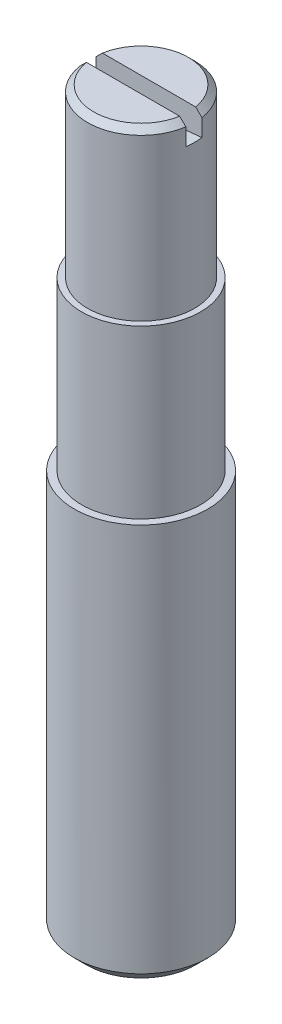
ISO-10303-21;
HEADER;
FILE_DESCRIPTION(('STEP AP214'),'2;1');
FILE_NAME('part.step','',(''),(''),'','','');
FILE_SCHEMA(('AUTOMOTIVE_DESIGN { 1 0 10303 214 1 1 1 1 }'));
ENDSEC;
DATA;
#1=APPLICATION_CONTEXT('core data for automotive mechanical design processes');
#2=APPLICATION_PROTOCOL_DEFINITION('international standard','automotive_design',2000,#1);
#3=PRODUCT_CONTEXT('',#1,'mechanical');
#4=PRODUCT('Part','Part','',(#3));
#5=PRODUCT_RELATED_PRODUCT_CATEGORY('part','',(#4));
#6=PRODUCT_DEFINITION_FORMATION('','',#4);
#7=PRODUCT_DEFINITION_CONTEXT('part definition',#1,'design');
#8=PRODUCT_DEFINITION('design','',#6,#7);
#9=PRODUCT_DEFINITION_SHAPE('','',#8);
#10=(LENGTH_UNIT() NAMED_UNIT(*) SI_UNIT(.MILLI.,.METRE.));
#11=(NAMED_UNIT(*) PLANE_ANGLE_UNIT() SI_UNIT($,.RADIAN.));
#12=(NAMED_UNIT(*) SI_UNIT($,.STERADIAN.) SOLID_ANGLE_UNIT());
#13=UNCERTAINTY_MEASURE_WITH_UNIT(LENGTH_MEASURE(1.E-05),#10,'distance_accuracy_value','');
#14=(GEOMETRIC_REPRESENTATION_CONTEXT(3) GLOBAL_UNCERTAINTY_ASSIGNED_CONTEXT((#13)) GLOBAL_UNIT_ASSIGNED_CONTEXT((#10,
#11,#12)) REPRESENTATION_CONTEXT('',''));
#15=CARTESIAN_POINT('',(0.,0.,0.));
#16=DIRECTION('',(0.,0.,1.));
#17=DIRECTION('',(1.,0.,0.));
#18=AXIS2_PLACEMENT_3D('',#15,#16,#17);
#19=CARTESIAN_POINT('',(0.,50.,0.));
#20=DIRECTION('',(0.,-1.,0.));
#21=DIRECTION('',(0.,0.,-1.));
#22=AXIS2_PLACEMENT_3D('',#19,#20,#21);
#23=PLANE('',#22);
#24=CARTESIAN_POINT('',(0.,50.0000000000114,0.));
#25=DIRECTION('',(0.,-1.,0.));
#26=DIRECTION('',(0.,0.,-1.));
#27=AXIS2_PLACEMENT_3D('',#24,#25,#26);
#28=CIRCLE('',#27,3.53999999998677);
#29=CARTESIAN_POINT('',(-3.48878202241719,50.0000000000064,-0.6));
#30=VERTEX_POINT('',#29);
#31=CARTESIAN_POINT('',(3.48878202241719,50.0000000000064,-0.6));
#32=VERTEX_POINT('',#31);
#33=EDGE_CURVE('E165',#30,#32,#28,.T.);
#34=ORIENTED_EDGE('',*,*,#33,.F.);
#35=DIRECTION('',(1.,0.,0.));
#36=VECTOR('',#35,1.);
#37=CARTESIAN_POINT('',(0.,50.,-0.6));
#38=LINE('',#37,#36);
#39=EDGE_CURVE('E163',#32,#30,#38,.F.);
#40=ORIENTED_EDGE('',*,*,#39,.F.);
#41=EDGE_LOOP('',(#34,#40));
#42=FACE_BOUND('',#41,.T.);
#43=ADVANCED_FACE('F14',(#42),#23,.F.);
#44=CARTESIAN_POINT('',(0.,50.,0.));
#45=DIRECTION('',(0.,-1.,0.));
#46=DIRECTION('',(0.,0.,-1.));
#47=AXIS2_PLACEMENT_3D('',#44,#45,#46);
#48=PLANE('',#47);
#49=DIRECTION('',(1.,0.,0.));
#50=VECTOR('',#49,1.);
#51=CARTESIAN_POINT('',(0.,50.,0.6));
#52=LINE('',#51,#50);
#53=CARTESIAN_POINT('',(-3.48878202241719,50.0000000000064,0.6));
#54=VERTEX_POINT('',#53);
#55=CARTESIAN_POINT('',(3.48878202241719,50.0000000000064,0.6));
#56=VERTEX_POINT('',#55);
#57=EDGE_CURVE('E161',#54,#56,#52,.T.);
#58=ORIENTED_EDGE('',*,*,#57,.F.);
#59=CARTESIAN_POINT('',(0.,50.0000000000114,0.));
#60=DIRECTION('',(0.,-1.,0.));
#61=DIRECTION('',(0.,0.,-1.));
#62=AXIS2_PLACEMENT_3D('',#59,#60,#61);
#63=CIRCLE('',#62,3.53999999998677);
#64=EDGE_CURVE('E159',#56,#54,#63,.T.);
#65=ORIENTED_EDGE('',*,*,#64,.F.);
#66=EDGE_LOOP('',(#58,#65));
#67=FACE_BOUND('',#66,.T.);
#68=ADVANCED_FACE('F121',(#67),#48,.F.);
#69=CARTESIAN_POINT('',(0.,49.5399999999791,0.));
#70=DIRECTION('',(0.,-1.,0.));
#71=DIRECTION('',(0.,0.,-1.));
#72=AXIS2_PLACEMENT_3D('',#69,#70,#71);
#73=CONICAL_SURFACE('',#72,3.99999999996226,0.785398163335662);
#74=CARTESIAN_POINT('',(-3.48878202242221,50.0000000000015,-0.6));
#75=CARTESIAN_POINT('',(-3.56650335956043,49.9233951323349,-0.6));
#76=CARTESIAN_POINT('',(-3.64419419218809,49.8467593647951,-0.6));
#77=CARTESIAN_POINT('',(-3.79951484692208,49.6934260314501,-0.6));
#78=CARTESIAN_POINT('',(-3.87714466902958,49.6167284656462,-0.6));
#79=CARTESIAN_POINT('',(-3.9547439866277,49.5399999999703,-0.6));
#80=B_SPLINE_CURVE_WITH_KNOTS('',3,(#74,#75,#76,#77,#78,#79),.UNSPECIFIED.,.F.,.F.,(4,2,4),(0.,
0.327383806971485,0.654767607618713),.UNSPECIFIED.);
#81=CARTESIAN_POINT('',(-3.95474398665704,49.5399999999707,-0.6));
#82=VERTEX_POINT('',#81);
#83=EDGE_CURVE('E39',#30,#82,#80,.T.);
#84=ORIENTED_EDGE('',*,*,#83,.F.);
#85=ORIENTED_EDGE('',*,*,#33,.T.);
#86=CARTESIAN_POINT('',(3.95474398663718,49.5399999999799,-0.600000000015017));
#87=CARTESIAN_POINT('',(3.87714466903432,49.616728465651,-0.600000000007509));
#88=CARTESIAN_POINT('',(3.79951484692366,49.6934260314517,-0.600000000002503));
#89=CARTESIAN_POINT('',(3.64419419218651,49.8467593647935,-0.599999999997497));
#90=CARTESIAN_POINT('',(3.56650335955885,49.9233951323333,-0.599999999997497));
#91=CARTESIAN_POINT('',(3.48878202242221,50.0000000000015,-0.6));
#92=B_SPLINE_CURVE_WITH_KNOTS('',3,(#86,#87,#88,#89,#90,#91),.UNSPECIFIED.,.F.,.F.,(4,2,4),(0.,
0.327383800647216,0.654767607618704),.UNSPECIFIED.);
#93=CARTESIAN_POINT('',(3.95474398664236,49.5399999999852,-0.6));
#94=VERTEX_POINT('',#93);
#95=EDGE_CURVE('E134',#94,#32,#92,.T.);
#96=ORIENTED_EDGE('',*,*,#95,.F.);
#97=CARTESIAN_POINT('',(0.,49.54,0.));
#98=DIRECTION('',(0.,-1.,0.));
#99=DIRECTION('',(0.,0.,-1.));
#100=AXIS2_PLACEMENT_3D('',#97,#98,#99);
#101=CIRCLE('',#100,4.);
#102=EDGE_CURVE('E175',#82,#94,#101,.T.);
#103=ORIENTED_EDGE('',*,*,#102,.F.);
#104=EDGE_LOOP('',(#84,#85,#96,#103));
#105=FACE_BOUND('',#104,.T.);
#106=ADVANCED_FACE('F116',(#105),#73,.T.);
#107=CARTESIAN_POINT('',(0.,79.5,-0.6));
#108=DIRECTION('',(0.,0.,1.));
#109=DIRECTION('',(1.,0.,0.));
#110=AXIS2_PLACEMENT_3D('',#107,#108,#109);
#111=PLANE('',#110);
#112=ORIENTED_EDGE('',*,*,#39,.T.);
#113=ORIENTED_EDGE('',*,*,#83,.T.);
#114=DIRECTION('',(0.,1.,0.));
#115=VECTOR('',#114,1.);
#116=CARTESIAN_POINT('',(-3.95474398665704,79.5,-0.6));
#117=LINE('',#116,#115);
#118=CARTESIAN_POINT('',(-3.95474398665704,48.2492400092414,-0.6));
#119=VERTEX_POINT('',#118);
#120=EDGE_CURVE('E154',#82,#119,#117,.F.);
#121=ORIENTED_EDGE('',*,*,#120,.T.);
#122=CARTESIAN_POINT('',(0.,79.5,-0.6));
#123=DIRECTION('',(0.,0.,-1.));
#124=DIRECTION('',(-1.,0.,0.));
#125=AXIS2_PLACEMENT_3D('',#122,#123,#124);
#126=CIRCLE('',#125,31.5);
#127=CARTESIAN_POINT('',(3.95474398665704,48.2492400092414,-0.6));
#128=VERTEX_POINT('',#127);
#129=EDGE_CURVE('E89',#119,#128,#126,.F.);
#130=ORIENTED_EDGE('',*,*,#129,.T.);
#131=DIRECTION('',(0.,1.,0.));
#132=VECTOR('',#131,1.);
#133=CARTESIAN_POINT('',(3.95474398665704,79.5,-0.6));
#134=LINE('',#133,#132);
#135=EDGE_CURVE('E140',#128,#94,#134,.T.);
#136=ORIENTED_EDGE('',*,*,#135,.T.);
#137=ORIENTED_EDGE('',*,*,#95,.T.);
#138=EDGE_LOOP('',(#112,#113,#121,#130,#136,#137));
#139=FACE_BOUND('',#138,.T.);
#140=ADVANCED_FACE('F120',(#139),#111,.T.);
#141=CARTESIAN_POINT('',(0.,49.5399999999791,0.));
#142=DIRECTION('',(0.,-1.,0.));
#143=DIRECTION('',(0.,0.,-1.));
#144=AXIS2_PLACEMENT_3D('',#141,#142,#143);
#145=CONICAL_SURFACE('',#144,3.99999999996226,0.785398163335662);
#146=ORIENTED_EDGE('',*,*,#64,.T.);
#147=CARTESIAN_POINT('',(-3.48878202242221,50.0000000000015,0.6));
#148=CARTESIAN_POINT('',(-3.56650335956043,49.9233951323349,0.6));
#149=CARTESIAN_POINT('',(-3.64419419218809,49.8467593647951,0.6));
#150=CARTESIAN_POINT('',(-3.79951484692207,49.6934260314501,0.6));
#151=CARTESIAN_POINT('',(-3.87714466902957,49.6167284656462,0.6));
#152=CARTESIAN_POINT('',(-3.95474398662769,49.5399999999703,0.6));
#153=B_SPLINE_CURVE_WITH_KNOTS('',3,(#147,#148,#149,#150,#151,#152),.UNSPECIFIED.,.F.,.F.,(4,2,
4),(0.,0.327383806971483,0.654767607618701),.UNSPECIFIED.);
#154=CARTESIAN_POINT('',(-3.95474398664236,49.5399999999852,0.6));
#155=VERTEX_POINT('',#154);
#156=EDGE_CURVE('E149',#54,#155,#153,.T.);
#157=ORIENTED_EDGE('',*,*,#156,.T.);
#158=CARTESIAN_POINT('',(0.,49.54,0.));
#159=DIRECTION('',(0.,-1.,0.));
#160=DIRECTION('',(0.,0.,-1.));
#161=AXIS2_PLACEMENT_3D('',#158,#159,#160);
#162=CIRCLE('',#161,4.);
#163=CARTESIAN_POINT('',(3.95474398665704,49.5399999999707,0.6));
#164=VERTEX_POINT('',#163);
#165=EDGE_CURVE('E79',#164,#155,#162,.T.);
#166=ORIENTED_EDGE('',*,*,#165,.F.);
#167=CARTESIAN_POINT('',(3.95474398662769,49.5399999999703,0.6));
#168=CARTESIAN_POINT('',(3.87714466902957,49.6167284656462,0.6));
#169=CARTESIAN_POINT('',(3.79951484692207,49.6934260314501,0.6));
#170=CARTESIAN_POINT('',(3.64419419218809,49.8467593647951,0.6));
#171=CARTESIAN_POINT('',(3.56650335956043,49.9233951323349,0.6));
#172=CARTESIAN_POINT('',(3.48878202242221,50.0000000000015,0.6));
#173=B_SPLINE_CURVE_WITH_KNOTS('',3,(#167,#168,#169,#170,#171,#172),.UNSPECIFIED.,.F.,.F.,(4,2,
4),(0.,0.327383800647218,0.654767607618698),.UNSPECIFIED.);
#174=EDGE_CURVE('E97',#164,#56,#173,.T.);
#175=ORIENTED_EDGE('',*,*,#174,.T.);
#176=EDGE_LOOP('',(#146,#157,#166,#175));
#177=FACE_BOUND('',#176,.T.);
#178=ADVANCED_FACE('F122',(#177),#145,.T.);
#179=CARTESIAN_POINT('',(0.,79.5,0.6));
#180=DIRECTION('',(0.,0.,1.));
#181=DIRECTION('',(1.,0.,0.));
#182=AXIS2_PLACEMENT_3D('',#179,#180,#181);
#183=PLANE('',#182);
#184=ORIENTED_EDGE('',*,*,#57,.T.);
#185=ORIENTED_EDGE('',*,*,#174,.F.);
#186=DIRECTION('',(0.,1.,0.));
#187=VECTOR('',#186,1.);
#188=CARTESIAN_POINT('',(3.95474398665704,79.5,0.6));
#189=LINE('',#188,#187);
#190=CARTESIAN_POINT('',(3.95474398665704,48.2492400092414,0.6));
#191=VERTEX_POINT('',#190);
#192=EDGE_CURVE('E95',#191,#164,#189,.T.);
#193=ORIENTED_EDGE('',*,*,#192,.F.);
#194=CARTESIAN_POINT('',(0.,79.5,0.6));
#195=DIRECTION('',(0.,0.,-1.));
#196=DIRECTION('',(-1.,0.,0.));
#197=AXIS2_PLACEMENT_3D('',#194,#195,#196);
#198=CIRCLE('',#197,31.5);
#199=CARTESIAN_POINT('',(-3.95474398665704,48.2492400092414,0.6));
#200=VERTEX_POINT('',#199);
#201=EDGE_CURVE('E82',#200,#191,#198,.F.);
#202=ORIENTED_EDGE('',*,*,#201,.F.);
#203=DIRECTION('',(0.,1.,0.));
#204=VECTOR('',#203,1.);
#205=CARTESIAN_POINT('',(-3.95474398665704,79.5,0.6));
#206=LINE('',#205,#204);
#207=EDGE_CURVE('E73',#155,#200,#206,.F.);
#208=ORIENTED_EDGE('',*,*,#207,.F.);
#209=ORIENTED_EDGE('',*,*,#156,.F.);
#210=EDGE_LOOP('',(#184,#185,#193,#202,#208,#209));
#211=FACE_BOUND('',#210,.T.);
#212=ADVANCED_FACE('F93',(#211),#183,.F.);
#213=CARTESIAN_POINT('',(0.,79.5,0.6));
#214=DIRECTION('',(0.,0.,-1.));
#215=DIRECTION('',(-1.,0.,0.));
#216=AXIS2_PLACEMENT_3D('',#213,#214,#215);
#217=CYLINDRICAL_SURFACE('',#216,31.5);
#218=CARTESIAN_POINT('',(3.95474398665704,48.2492400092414,-0.6));
#219=CARTESIAN_POINT('',(3.96984984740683,48.2511544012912,-0.500484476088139));
#220=CARTESIAN_POINT('',(3.98118553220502,48.2525972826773,-0.40038868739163));
#221=CARTESIAN_POINT('',(3.9962389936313,48.2545175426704,-0.20019306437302));
#222=CARTESIAN_POINT('',(4.,48.2550004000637,-0.10009653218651));
#223=CARTESIAN_POINT('',(4.,48.2550004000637,0.10009653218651));
#224=CARTESIAN_POINT('',(3.9962389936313,48.2545175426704,0.20019306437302));
#225=CARTESIAN_POINT('',(3.98118553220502,48.2525972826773,0.40038868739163));
#226=CARTESIAN_POINT('',(3.96984984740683,48.2511544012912,0.500484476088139));
#227=CARTESIAN_POINT('',(3.95474398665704,48.2492400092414,0.6));
#228=B_SPLINE_CURVE_WITH_KNOTS('',3,(#218,#219,#220,#221,#222,#223,#224,#225,#226,#227),
.UNSPECIFIED.,.F.,.F.,(4,2,2,2,4),(0.,0.301946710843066,0.602165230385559,0.902383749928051,
1.20433046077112),.UNSPECIFIED.);
#229=EDGE_CURVE('E83',#128,#191,#228,.T.);
#230=ORIENTED_EDGE('',*,*,#229,.F.);
#231=ORIENTED_EDGE('',*,*,#129,.F.);
#232=CARTESIAN_POINT('',(-3.95474398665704,48.2492400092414,0.6));
#233=CARTESIAN_POINT('',(-3.96984984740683,48.2511544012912,0.500484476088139));
#234=CARTESIAN_POINT('',(-3.98118553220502,48.2525972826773,0.40038868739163));
#235=CARTESIAN_POINT('',(-3.9962389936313,48.2545175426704,0.20019306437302));
#236=CARTESIAN_POINT('',(-4.,48.2550004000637,0.10009653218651));
#237=CARTESIAN_POINT('',(-4.,48.2550004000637,-0.10009653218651));
#238=CARTESIAN_POINT('',(-3.9962389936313,48.2545175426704,-0.20019306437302));
#239=CARTESIAN_POINT('',(-3.98118553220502,48.2525972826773,-0.40038868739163));
#240=CARTESIAN_POINT('',(-3.96984984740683,48.2511544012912,-0.500484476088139));
#241=CARTESIAN_POINT('',(-3.95474398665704,48.2492400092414,-0.6));
#242=B_SPLINE_CURVE_WITH_KNOTS('',3,(#232,#233,#234,#235,#236,#237,#238,#239,#240,#241),
.UNSPECIFIED.,.F.,.F.,(4,2,2,2,4),(0.,0.301946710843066,0.602165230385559,0.902383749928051,
1.20433046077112),.UNSPECIFIED.);
#243=EDGE_CURVE('E19',#200,#119,#242,.T.);
#244=ORIENTED_EDGE('',*,*,#243,.F.);
#245=ORIENTED_EDGE('',*,*,#201,.T.);
#246=EDGE_LOOP('',(#230,#231,#244,#245));
#247=FACE_BOUND('',#246,.T.);
#248=ADVANCED_FACE('F16',(#247),#217,.F.);
#249=CARTESIAN_POINT('',(0.,37.5,0.));
#250=DIRECTION('',(0.,-1.,0.));
#251=DIRECTION('',(0.,0.,-1.));
#252=AXIS2_PLACEMENT_3D('',#249,#250,#251);
#253=CYLINDRICAL_SURFACE('',#252,4.);
#254=ORIENTED_EDGE('',*,*,#229,.T.);
#255=ORIENTED_EDGE('',*,*,#192,.T.);
#256=ORIENTED_EDGE('',*,*,#165,.T.);
#257=ORIENTED_EDGE('',*,*,#207,.T.);
#258=ORIENTED_EDGE('',*,*,#243,.T.);
#259=ORIENTED_EDGE('',*,*,#120,.F.);
#260=ORIENTED_EDGE('',*,*,#102,.T.);
#261=ORIENTED_EDGE('',*,*,#135,.F.);
#262=EDGE_LOOP('',(#254,#255,#256,#257,#258,#259,#260,#261));
#263=FACE_BOUND('',#262,.T.);
#264=CARTESIAN_POINT('',(0.,37.5,0.));
#265=DIRECTION('',(0.,-1.,0.));
#266=DIRECTION('',(0.,0.,-1.));
#267=AXIS2_PLACEMENT_3D('',#264,#265,#266);
#268=CIRCLE('',#267,4.);
#269=CARTESIAN_POINT('',(0.,37.5,-4.));
#270=VERTEX_POINT('',#269);
#271=EDGE_CURVE('E171',#270,#270,#268,.F.);
#272=ORIENTED_EDGE('',*,*,#271,.T.);
#273=EDGE_LOOP('',(#272));
#274=FACE_BOUND('',#273,.T.);
#275=ADVANCED_FACE('F75',(#263,#274),#253,.T.);
#276=CARTESIAN_POINT('',(0.,37.5,0.));
#277=DIRECTION('',(0.,-1.,0.));
#278=DIRECTION('',(0.,0.,-1.));
#279=AXIS2_PLACEMENT_3D('',#276,#277,#278);
#280=PLANE('',#279);
#281=ORIENTED_EDGE('',*,*,#271,.F.);
#282=EDGE_LOOP('',(#281));
#283=FACE_BOUND('',#282,.T.);
#284=CARTESIAN_POINT('',(0.,37.5,0.));
#285=DIRECTION('',(0.,-1.,0.));
#286=DIRECTION('',(0.,0.,-1.));
#287=AXIS2_PLACEMENT_3D('',#284,#285,#286);
#288=CIRCLE('',#287,4.45);
#289=CARTESIAN_POINT('',(0.,37.5,-4.45));
#290=VERTEX_POINT('',#289);
#291=EDGE_CURVE('E174',#290,#290,#288,.T.);
#292=ORIENTED_EDGE('',*,*,#291,.F.);
#293=EDGE_LOOP('',(#292));
#294=FACE_BOUND('',#293,.T.);
#295=ADVANCED_FACE('F114',(#283,#294),#280,.F.);
#296=CARTESIAN_POINT('',(0.,25.,0.));
#297=DIRECTION('',(0.,-1.,0.));
#298=DIRECTION('',(0.,0.,-1.));
#299=AXIS2_PLACEMENT_3D('',#296,#297,#298);
#300=CYLINDRICAL_SURFACE('',#299,4.45);
#301=ORIENTED_EDGE('',*,*,#291,.T.);
#302=EDGE_LOOP('',(#301));
#303=FACE_BOUND('',#302,.T.);
#304=CARTESIAN_POINT('',(0.,25.,0.));
#305=DIRECTION('',(0.,-1.,0.));
#306=DIRECTION('',(0.,0.,-1.));
#307=AXIS2_PLACEMENT_3D('',#304,#305,#306);
#308=CIRCLE('',#307,4.45);
#309=CARTESIAN_POINT('',(0.,25.,-4.45));
#310=VERTEX_POINT('',#309);
#311=EDGE_CURVE('E30',#310,#310,#308,.F.);
#312=ORIENTED_EDGE('',*,*,#311,.T.);
#313=EDGE_LOOP('',(#312));
#314=FACE_BOUND('',#313,.T.);
#315=ADVANCED_FACE('F218',(#303,#314),#300,.T.);
#316=CARTESIAN_POINT('',(0.,25.,0.));
#317=DIRECTION('',(0.,-1.,0.));
#318=DIRECTION('',(0.,0.,-1.));
#319=AXIS2_PLACEMENT_3D('',#316,#317,#318);
#320=PLANE('',#319);
#321=ORIENTED_EDGE('',*,*,#311,.F.);
#322=EDGE_LOOP('',(#321));
#323=FACE_BOUND('',#322,.T.);
#324=CARTESIAN_POINT('',(0.,25.,0.));
#325=DIRECTION('',(0.,-1.,0.));
#326=DIRECTION('',(0.,0.,-1.));
#327=AXIS2_PLACEMENT_3D('',#324,#325,#326);
#328=CIRCLE('',#327,5.);
#329=CARTESIAN_POINT('',(0.,25.,-5.));
#330=VERTEX_POINT('',#329);
#331=EDGE_CURVE('E9',#330,#330,#328,.T.);
#332=ORIENTED_EDGE('',*,*,#331,.F.);
#333=EDGE_LOOP('',(#332));
#334=FACE_BOUND('',#333,.T.);
#335=ADVANCED_FACE('F213',(#323,#334),#320,.F.);
#336=CARTESIAN_POINT('',(0.,0.,0.));
#337=DIRECTION('',(0.,-1.,0.));
#338=DIRECTION('',(0.,0.,-1.));
#339=AXIS2_PLACEMENT_3D('',#336,#337,#338);
#340=CYLINDRICAL_SURFACE('',#339,5.);
#341=ORIENTED_EDGE('',*,*,#331,.T.);
#342=EDGE_LOOP('',(#341));
#343=FACE_BOUND('',#342,.T.);
#344=CARTESIAN_POINT('',(0.,-4.08,0.));
#345=DIRECTION('',(0.,-1.,0.));
#346=DIRECTION('',(0.,0.,-1.));
#347=AXIS2_PLACEMENT_3D('',#344,#345,#346);
#348=CIRCLE('',#347,5.);
#349=CARTESIAN_POINT('',(0.,-4.08,-5.));
#350=VERTEX_POINT('',#349);
#351=EDGE_CURVE('E191',#350,#350,#348,.F.);
#352=ORIENTED_EDGE('',*,*,#351,.T.);
#353=EDGE_LOOP('',(#352));
#354=FACE_BOUND('',#353,.T.);
#355=ADVANCED_FACE('F203',(#343,#354),#340,.T.);
#356=CARTESIAN_POINT('',(4.08,-5.,0.));
#357=DIRECTION('',(0.,1.,0.));
#358=DIRECTION('',(0.,0.,1.));
#359=AXIS2_PLACEMENT_3D('',#356,#357,#358);
#360=PLANE('',#359);
#361=CARTESIAN_POINT('',(0.,-4.99999999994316,0.));
#362=DIRECTION('',(0.,1.,0.));
#363=DIRECTION('',(0.,0.,1.));
#364=AXIS2_PLACEMENT_3D('',#361,#362,#363);
#365=CIRCLE('',#364,4.07999999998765);
#366=CARTESIAN_POINT('',(0.,-4.99999999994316,4.07999999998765));
#367=VERTEX_POINT('',#366);
#368=EDGE_CURVE('E91',#367,#367,#365,.T.);
#369=ORIENTED_EDGE('',*,*,#368,.F.);
#370=EDGE_LOOP('',(#369));
#371=FACE_BOUND('',#370,.T.);
#372=ADVANCED_FACE('F201',(#371),#360,.F.);
#373=CARTESIAN_POINT('',(0.,-4.07999999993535,0.));
#374=DIRECTION('',(0.,1.,0.));
#375=DIRECTION('',(0.,0.,1.));
#376=AXIS2_PLACEMENT_3D('',#373,#374,#375);
#377=CONICAL_SURFACE('',#376,4.99999999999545,0.785398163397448);
#378=ORIENTED_EDGE('',*,*,#351,.F.);
#379=EDGE_LOOP('',(#378));
#380=FACE_BOUND('',#379,.T.);
#381=ORIENTED_EDGE('',*,*,#368,.T.);
#382=EDGE_LOOP('',(#381));
#383=FACE_BOUND('',#382,.T.);
#384=ADVANCED_FACE('F199',(#380,#383),#377,.T.);
#385=CLOSED_SHELL('',(#43,#68,#106,#140,#178,#212,#248,#275,#295,#315,#335,#355,#372,#384));
#386=MANIFOLD_SOLID_BREP('B1',#385);
#387=ADVANCED_BREP_SHAPE_REPRESENTATION('',(#18,#386),#14);
#388=SHAPE_DEFINITION_REPRESENTATION(#9,#387);
ENDSEC;
END-ISO-10303-21;
